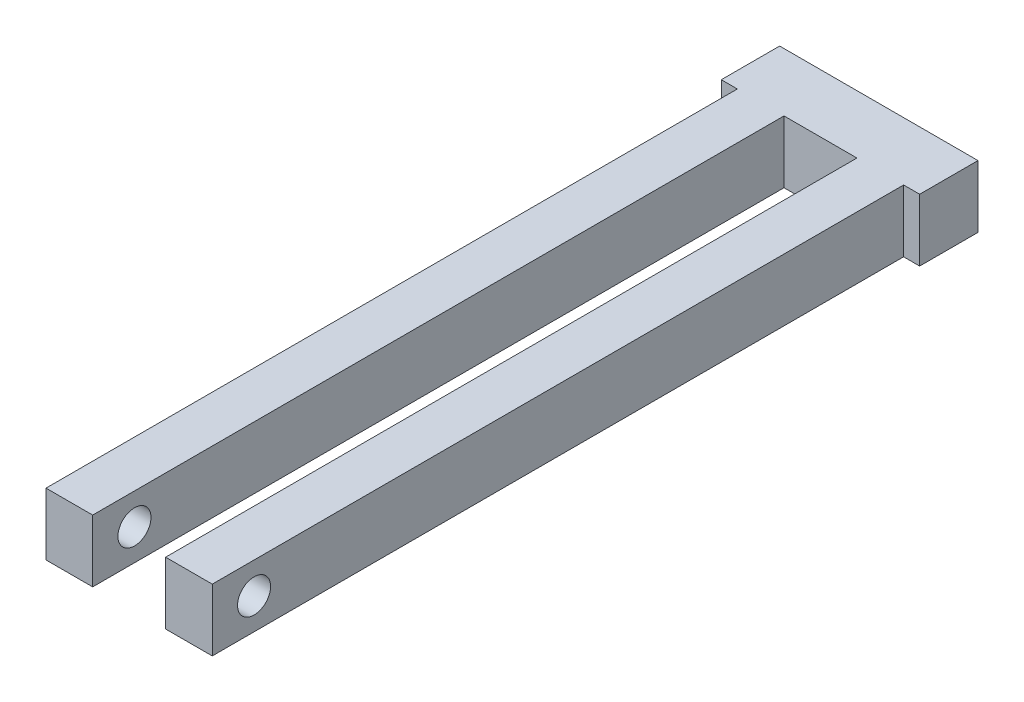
ISO-10303-21;
HEADER;
FILE_DESCRIPTION(('STEP AP214'),'2;1');
FILE_NAME('part.step','',(''),(''),'','','');
FILE_SCHEMA(('AUTOMOTIVE_DESIGN { 1 0 10303 214 1 1 1 1 }'));
ENDSEC;
DATA;
#1=APPLICATION_CONTEXT('core data for automotive mechanical design processes');
#2=APPLICATION_PROTOCOL_DEFINITION('international standard','automotive_design',2000,#1);
#3=PRODUCT_CONTEXT('',#1,'mechanical');
#4=PRODUCT('Part','Part','',(#3));
#5=PRODUCT_RELATED_PRODUCT_CATEGORY('part','',(#4));
#6=PRODUCT_DEFINITION_FORMATION('','',#4);
#7=PRODUCT_DEFINITION_CONTEXT('part definition',#1,'design');
#8=PRODUCT_DEFINITION('design','',#6,#7);
#9=PRODUCT_DEFINITION_SHAPE('','',#8);
#10=(LENGTH_UNIT() NAMED_UNIT(*) SI_UNIT(.MILLI.,.METRE.));
#11=(NAMED_UNIT(*) PLANE_ANGLE_UNIT() SI_UNIT($,.RADIAN.));
#12=(NAMED_UNIT(*) SI_UNIT($,.STERADIAN.) SOLID_ANGLE_UNIT());
#13=UNCERTAINTY_MEASURE_WITH_UNIT(LENGTH_MEASURE(1.E-05),#10,'distance_accuracy_value','');
#14=(GEOMETRIC_REPRESENTATION_CONTEXT(3) GLOBAL_UNCERTAINTY_ASSIGNED_CONTEXT((#13)) GLOBAL_UNIT_ASSIGNED_CONTEXT((#10,
#11,#12)) REPRESENTATION_CONTEXT('',''));
#15=CARTESIAN_POINT('',(0.,0.,0.));
#16=DIRECTION('',(0.,0.,1.));
#17=DIRECTION('',(1.,0.,0.));
#18=AXIS2_PLACEMENT_3D('',#15,#16,#17);
#19=CARTESIAN_POINT('',(0.,44.,-124.));
#20=DIRECTION('',(0.,0.,1.));
#21=DIRECTION('',(1.,0.,0.));
#22=AXIS2_PLACEMENT_3D('',#19,#20,#21);
#23=PLANE('',#22);
#24=DIRECTION('',(0.,-1.,0.));
#25=VECTOR('',#24,1.);
#26=CARTESIAN_POINT('',(3.75,44.,-124.));
#27=LINE('',#26,#25);
#28=CARTESIAN_POINT('',(3.75,47.2,-124.));
#29=VERTEX_POINT('',#28);
#30=CARTESIAN_POINT('',(3.75,40.8,-124.));
#31=VERTEX_POINT('',#30);
#32=EDGE_CURVE('E139',#29,#31,#27,.T.);
#33=ORIENTED_EDGE('',*,*,#32,.F.);
#34=DIRECTION('',(1.,0.,0.));
#35=VECTOR('',#34,1.);
#36=CARTESIAN_POINT('',(0.,47.2,-124.));
#37=LINE('',#36,#35);
#38=CARTESIAN_POINT('',(-3.75,47.2,-124.));
#39=VERTEX_POINT('',#38);
#40=EDGE_CURVE('E197',#39,#29,#37,.T.);
#41=ORIENTED_EDGE('',*,*,#40,.F.);
#42=DIRECTION('',(0.,1.,0.));
#43=VECTOR('',#42,1.);
#44=CARTESIAN_POINT('',(-3.75,44.,-124.));
#45=LINE('',#44,#43);
#46=CARTESIAN_POINT('',(-3.75,40.8,-124.));
#47=VERTEX_POINT('',#46);
#48=EDGE_CURVE('E159',#47,#39,#45,.T.);
#49=ORIENTED_EDGE('',*,*,#48,.F.);
#50=DIRECTION('',(-1.,0.,0.));
#51=VECTOR('',#50,1.);
#52=CARTESIAN_POINT('',(0.,40.8,-124.));
#53=LINE('',#52,#51);
#54=EDGE_CURVE('E25',#31,#47,#53,.T.);
#55=ORIENTED_EDGE('',*,*,#54,.F.);
#56=EDGE_LOOP('',(#33,#41,#49,#55));
#57=FACE_BOUND('',#56,.T.);
#58=ADVANCED_FACE('F16',(#57),#23,.T.);
#59=DIRECTION('',(0.,-1.,0.));
#60=VECTOR('',#59,1.);
#61=CARTESIAN_POINT('',(-8.55,44.,-124.));
#62=LINE('',#61,#60);
#63=CARTESIAN_POINT('',(-8.55,47.2,-124.));
#64=VERTEX_POINT('',#63);
#65=CARTESIAN_POINT('',(-8.55,40.8,-124.));
#66=VERTEX_POINT('',#65);
#67=EDGE_CURVE('E162',#64,#66,#62,.T.);
#68=ORIENTED_EDGE('',*,*,#67,.F.);
#69=CARTESIAN_POINT('',(-10.2,47.2,-124.));
#70=VERTEX_POINT('',#69);
#71=EDGE_CURVE('E194',#70,#64,#37,.T.);
#72=ORIENTED_EDGE('',*,*,#71,.F.);
#73=DIRECTION('',(0.,1.,0.));
#74=VECTOR('',#73,1.);
#75=CARTESIAN_POINT('',(-10.2,44.,-124.));
#76=LINE('',#75,#74);
#77=CARTESIAN_POINT('',(-10.2,40.8,-124.));
#78=VERTEX_POINT('',#77);
#79=EDGE_CURVE('E198',#78,#70,#76,.T.);
#80=ORIENTED_EDGE('',*,*,#79,.F.);
#81=EDGE_CURVE('E27',#66,#78,#53,.T.);
#82=ORIENTED_EDGE('',*,*,#81,.F.);
#83=EDGE_LOOP('',(#68,#72,#80,#82));
#84=FACE_BOUND('',#83,.T.);
#85=ADVANCED_FACE('F220',(#84),#23,.T.);
#86=DIRECTION('',(0.,1.,0.));
#87=VECTOR('',#86,1.);
#88=CARTESIAN_POINT('',(8.55,44.,-124.));
#89=LINE('',#88,#87);
#90=CARTESIAN_POINT('',(8.55,40.8,-124.));
#91=VERTEX_POINT('',#90);
#92=CARTESIAN_POINT('',(8.55,47.2,-124.));
#93=VERTEX_POINT('',#92);
#94=EDGE_CURVE('E37',#91,#93,#89,.T.);
#95=ORIENTED_EDGE('',*,*,#94,.F.);
#96=CARTESIAN_POINT('',(10.2,40.8,-124.));
#97=VERTEX_POINT('',#96);
#98=EDGE_CURVE('E10',#97,#91,#53,.T.);
#99=ORIENTED_EDGE('',*,*,#98,.F.);
#100=DIRECTION('',(0.,-1.,0.));
#101=VECTOR('',#100,1.);
#102=CARTESIAN_POINT('',(10.2,44.,-124.));
#103=LINE('',#102,#101);
#104=CARTESIAN_POINT('',(10.2,47.2,-124.));
#105=VERTEX_POINT('',#104);
#106=EDGE_CURVE('E188',#105,#97,#103,.T.);
#107=ORIENTED_EDGE('',*,*,#106,.F.);
#108=EDGE_CURVE('E195',#93,#105,#37,.T.);
#109=ORIENTED_EDGE('',*,*,#108,.F.);
#110=EDGE_LOOP('',(#95,#99,#107,#109));
#111=FACE_BOUND('',#110,.T.);
#112=ADVANCED_FACE('F18',(#111),#23,.T.);
#113=CARTESIAN_POINT('',(0.,40.8,-130.));
#114=DIRECTION('',(0.,-1.,0.));
#115=DIRECTION('',(0.,0.,-1.));
#116=AXIS2_PLACEMENT_3D('',#113,#114,#115);
#117=PLANE('',#116);
#118=ORIENTED_EDGE('',*,*,#98,.T.);
#119=DIRECTION('',(0.,0.,1.));
#120=VECTOR('',#119,1.);
#121=CARTESIAN_POINT('',(8.55,40.8,-124.35));
#122=LINE('',#121,#120);
#123=CARTESIAN_POINT('',(8.55,40.8,-52.9));
#124=VERTEX_POINT('',#123);
#125=EDGE_CURVE('E104',#91,#124,#122,.T.);
#126=ORIENTED_EDGE('',*,*,#125,.T.);
#127=DIRECTION('',(-1.,0.,0.));
#128=VECTOR('',#127,1.);
#129=CARTESIAN_POINT('',(6.15,40.8,-52.9));
#130=LINE('',#129,#128);
#131=CARTESIAN_POINT('',(3.75,40.8,-52.9));
#132=VERTEX_POINT('',#131);
#133=EDGE_CURVE('E108',#124,#132,#130,.T.);
#134=ORIENTED_EDGE('',*,*,#133,.T.);
#135=DIRECTION('',(0.,0.,1.));
#136=VECTOR('',#135,1.);
#137=CARTESIAN_POINT('',(3.75,40.8,-124.35));
#138=LINE('',#137,#136);
#139=EDGE_CURVE('E127',#31,#132,#138,.T.);
#140=ORIENTED_EDGE('',*,*,#139,.F.);
#141=ORIENTED_EDGE('',*,*,#54,.T.);
#142=DIRECTION('',(0.,0.,1.));
#143=VECTOR('',#142,1.);
#144=CARTESIAN_POINT('',(-3.75,40.8,-124.35));
#145=LINE('',#144,#143);
#146=CARTESIAN_POINT('',(-3.75,40.8,-52.9));
#147=VERTEX_POINT('',#146);
#148=EDGE_CURVE('E138',#47,#147,#145,.T.);
#149=ORIENTED_EDGE('',*,*,#148,.T.);
#150=DIRECTION('',(-1.,0.,0.));
#151=VECTOR('',#150,1.);
#152=CARTESIAN_POINT('',(-6.15,40.8,-52.9));
#153=LINE('',#152,#151);
#154=CARTESIAN_POINT('',(-8.55,40.8,-52.9));
#155=VERTEX_POINT('',#154);
#156=EDGE_CURVE('E160',#147,#155,#153,.T.);
#157=ORIENTED_EDGE('',*,*,#156,.T.);
#158=DIRECTION('',(0.,0.,1.));
#159=VECTOR('',#158,1.);
#160=CARTESIAN_POINT('',(-8.55,40.8,-124.35));
#161=LINE('',#160,#159);
#162=EDGE_CURVE('E148',#66,#155,#161,.T.);
#163=ORIENTED_EDGE('',*,*,#162,.F.);
#164=ORIENTED_EDGE('',*,*,#81,.T.);
#165=DIRECTION('',(0.,0.,1.));
#166=VECTOR('',#165,1.);
#167=CARTESIAN_POINT('',(-10.2,40.8,-130.));
#168=LINE('',#167,#166);
#169=CARTESIAN_POINT('',(-10.2,40.8,-130.));
#170=VERTEX_POINT('',#169);
#171=EDGE_CURVE('E186',#170,#78,#168,.T.);
#172=ORIENTED_EDGE('',*,*,#171,.F.);
#173=DIRECTION('',(1.,0.,0.));
#174=VECTOR('',#173,1.);
#175=CARTESIAN_POINT('',(0.,40.8,-130.));
#176=LINE('',#175,#174);
#177=CARTESIAN_POINT('',(10.2,40.8,-130.));
#178=VERTEX_POINT('',#177);
#179=EDGE_CURVE('E167',#170,#178,#176,.T.);
#180=ORIENTED_EDGE('',*,*,#179,.T.);
#181=DIRECTION('',(0.,0.,1.));
#182=VECTOR('',#181,1.);
#183=CARTESIAN_POINT('',(10.2,40.8,-130.));
#184=LINE('',#183,#182);
#185=EDGE_CURVE('E174',#178,#97,#184,.T.);
#186=ORIENTED_EDGE('',*,*,#185,.T.);
#187=EDGE_LOOP('',(#118,#126,#134,#140,#141,#149,#157,#163,#164,#172,#180,#186));
#188=FACE_BOUND('',#187,.T.);
#189=ADVANCED_FACE('F110',(#188),#117,.T.);
#190=CARTESIAN_POINT('',(-10.2,44.,-130.));
#191=DIRECTION('',(-1.,0.,0.));
#192=DIRECTION('',(0.,0.,1.));
#193=AXIS2_PLACEMENT_3D('',#190,#191,#192);
#194=PLANE('',#193);
#195=ORIENTED_EDGE('',*,*,#171,.T.);
#196=ORIENTED_EDGE('',*,*,#79,.T.);
#197=DIRECTION('',(0.,0.,1.));
#198=VECTOR('',#197,1.);
#199=CARTESIAN_POINT('',(-10.2,47.2,-130.));
#200=LINE('',#199,#198);
#201=CARTESIAN_POINT('',(-10.2,47.2,-130.));
#202=VERTEX_POINT('',#201);
#203=EDGE_CURVE('E183',#202,#70,#200,.T.);
#204=ORIENTED_EDGE('',*,*,#203,.F.);
#205=DIRECTION('',(0.,-1.,0.));
#206=VECTOR('',#205,1.);
#207=CARTESIAN_POINT('',(-10.2,44.,-130.));
#208=LINE('',#207,#206);
#209=EDGE_CURVE('E166',#202,#170,#208,.T.);
#210=ORIENTED_EDGE('',*,*,#209,.T.);
#211=EDGE_LOOP('',(#195,#196,#204,#210));
#212=FACE_BOUND('',#211,.T.);
#213=ADVANCED_FACE('F225',(#212),#194,.T.);
#214=CARTESIAN_POINT('',(0.,47.2,-130.));
#215=DIRECTION('',(0.,1.,0.));
#216=DIRECTION('',(0.,0.,1.));
#217=AXIS2_PLACEMENT_3D('',#214,#215,#216);
#218=PLANE('',#217);
#219=ORIENTED_EDGE('',*,*,#40,.T.);
#220=DIRECTION('',(0.,0.,1.));
#221=VECTOR('',#220,1.);
#222=CARTESIAN_POINT('',(3.75,47.2,-124.35));
#223=LINE('',#222,#221);
#224=CARTESIAN_POINT('',(3.75,47.2,-52.9));
#225=VERTEX_POINT('',#224);
#226=EDGE_CURVE('E135',#29,#225,#223,.T.);
#227=ORIENTED_EDGE('',*,*,#226,.T.);
#228=DIRECTION('',(1.,0.,0.));
#229=VECTOR('',#228,1.);
#230=CARTESIAN_POINT('',(6.15,47.2,-52.9));
#231=LINE('',#230,#229);
#232=CARTESIAN_POINT('',(8.55,47.2,-52.9));
#233=VERTEX_POINT('',#232);
#234=EDGE_CURVE('E128',#225,#233,#231,.T.);
#235=ORIENTED_EDGE('',*,*,#234,.T.);
#236=DIRECTION('',(0.,0.,1.));
#237=VECTOR('',#236,1.);
#238=CARTESIAN_POINT('',(8.55,47.2,-124.35));
#239=LINE('',#238,#237);
#240=EDGE_CURVE('E111',#93,#233,#239,.T.);
#241=ORIENTED_EDGE('',*,*,#240,.F.);
#242=ORIENTED_EDGE('',*,*,#108,.T.);
#243=DIRECTION('',(0.,0.,1.));
#244=VECTOR('',#243,1.);
#245=CARTESIAN_POINT('',(10.2,47.2,-130.));
#246=LINE('',#245,#244);
#247=CARTESIAN_POINT('',(10.2,47.2,-130.));
#248=VERTEX_POINT('',#247);
#249=EDGE_CURVE('E179',#248,#105,#246,.T.);
#250=ORIENTED_EDGE('',*,*,#249,.F.);
#251=DIRECTION('',(-1.,0.,0.));
#252=VECTOR('',#251,1.);
#253=CARTESIAN_POINT('',(0.,47.2,-130.));
#254=LINE('',#253,#252);
#255=EDGE_CURVE('E173',#248,#202,#254,.T.);
#256=ORIENTED_EDGE('',*,*,#255,.T.);
#257=ORIENTED_EDGE('',*,*,#203,.T.);
#258=ORIENTED_EDGE('',*,*,#71,.T.);
#259=DIRECTION('',(0.,0.,1.));
#260=VECTOR('',#259,1.);
#261=CARTESIAN_POINT('',(-8.55,47.2,-124.35));
#262=LINE('',#261,#260);
#263=CARTESIAN_POINT('',(-8.55,47.2,-52.9));
#264=VERTEX_POINT('',#263);
#265=EDGE_CURVE('E145',#64,#264,#262,.T.);
#266=ORIENTED_EDGE('',*,*,#265,.T.);
#267=DIRECTION('',(1.,0.,0.));
#268=VECTOR('',#267,1.);
#269=CARTESIAN_POINT('',(-6.15,47.2,-52.9));
#270=LINE('',#269,#268);
#271=CARTESIAN_POINT('',(-3.75,47.2,-52.9));
#272=VERTEX_POINT('',#271);
#273=EDGE_CURVE('E151',#264,#272,#270,.T.);
#274=ORIENTED_EDGE('',*,*,#273,.T.);
#275=DIRECTION('',(0.,0.,1.));
#276=VECTOR('',#275,1.);
#277=CARTESIAN_POINT('',(-3.75,47.2,-124.35));
#278=LINE('',#277,#276);
#279=EDGE_CURVE('E142',#39,#272,#278,.T.);
#280=ORIENTED_EDGE('',*,*,#279,.F.);
#281=EDGE_LOOP('',(#219,#227,#235,#241,#242,#250,#256,#257,#258,#266,#274,#280));
#282=FACE_BOUND('',#281,.T.);
#283=ADVANCED_FACE('F218',(#282),#218,.T.);
#284=CARTESIAN_POINT('',(0.,44.,-130.));
#285=DIRECTION('',(0.,0.,-1.));
#286=DIRECTION('',(-1.,0.,0.));
#287=AXIS2_PLACEMENT_3D('',#284,#285,#286);
#288=PLANE('',#287);
#289=DIRECTION('',(0.,1.,0.));
#290=VECTOR('',#289,1.);
#291=CARTESIAN_POINT('',(10.2,44.,-130.));
#292=LINE('',#291,#290);
#293=EDGE_CURVE('E168',#178,#248,#292,.T.);
#294=ORIENTED_EDGE('',*,*,#293,.F.);
#295=ORIENTED_EDGE('',*,*,#179,.F.);
#296=ORIENTED_EDGE('',*,*,#209,.F.);
#297=ORIENTED_EDGE('',*,*,#255,.F.);
#298=EDGE_LOOP('',(#294,#295,#296,#297));
#299=FACE_BOUND('',#298,.T.);
#300=ADVANCED_FACE('F226',(#299),#288,.T.);
#301=CARTESIAN_POINT('',(10.2,44.,-130.));
#302=DIRECTION('',(1.,0.,0.));
#303=DIRECTION('',(0.,0.,-1.));
#304=AXIS2_PLACEMENT_3D('',#301,#302,#303);
#305=PLANE('',#304);
#306=ORIENTED_EDGE('',*,*,#293,.T.);
#307=ORIENTED_EDGE('',*,*,#249,.T.);
#308=ORIENTED_EDGE('',*,*,#106,.T.);
#309=ORIENTED_EDGE('',*,*,#185,.F.);
#310=EDGE_LOOP('',(#306,#307,#308,#309));
#311=FACE_BOUND('',#310,.T.);
#312=ADVANCED_FACE('F229',(#311),#305,.T.);
#313=CARTESIAN_POINT('',(-6.15,44.,-52.9));
#314=DIRECTION('',(0.,0.,1.));
#315=DIRECTION('',(1.,0.,0.));
#316=AXIS2_PLACEMENT_3D('',#313,#314,#315);
#317=PLANE('',#316);
#318=ORIENTED_EDGE('',*,*,#156,.F.);
#319=DIRECTION('',(0.,-1.,0.));
#320=VECTOR('',#319,1.);
#321=CARTESIAN_POINT('',(-3.75,44.,-52.9));
#322=LINE('',#321,#320);
#323=EDGE_CURVE('E146',#272,#147,#322,.T.);
#324=ORIENTED_EDGE('',*,*,#323,.F.);
#325=ORIENTED_EDGE('',*,*,#273,.F.);
#326=DIRECTION('',(0.,1.,0.));
#327=VECTOR('',#326,1.);
#328=CARTESIAN_POINT('',(-8.55,44.,-52.9));
#329=LINE('',#328,#327);
#330=EDGE_CURVE('E152',#155,#264,#329,.T.);
#331=ORIENTED_EDGE('',*,*,#330,.F.);
#332=EDGE_LOOP('',(#318,#324,#325,#331));
#333=FACE_BOUND('',#332,.T.);
#334=ADVANCED_FACE('F211',(#333),#317,.T.);
#335=CARTESIAN_POINT('',(-8.55,44.,-124.35));
#336=DIRECTION('',(-1.,0.,0.));
#337=DIRECTION('',(0.,0.,1.));
#338=AXIS2_PLACEMENT_3D('',#335,#336,#337);
#339=PLANE('',#338);
#340=CARTESIAN_POINT('',(-8.55,44.,-57.2));
#341=DIRECTION('',(-1.,0.,0.));
#342=DIRECTION('',(0.,0.,1.));
#343=AXIS2_PLACEMENT_3D('',#340,#341,#342);
#344=CIRCLE('',#343,1.7);
#345=CARTESIAN_POINT('',(-8.55,44.,-55.5));
#346=VERTEX_POINT('',#345);
#347=EDGE_CURVE('E113',#346,#346,#344,.T.);
#348=ORIENTED_EDGE('',*,*,#347,.F.);
#349=EDGE_LOOP('',(#348));
#350=FACE_BOUND('',#349,.T.);
#351=ORIENTED_EDGE('',*,*,#265,.F.);
#352=ORIENTED_EDGE('',*,*,#67,.T.);
#353=ORIENTED_EDGE('',*,*,#162,.T.);
#354=ORIENTED_EDGE('',*,*,#330,.T.);
#355=EDGE_LOOP('',(#351,#352,#353,#354));
#356=FACE_BOUND('',#355,.T.);
#357=ADVANCED_FACE('F214',(#350,#356),#339,.T.);
#358=CARTESIAN_POINT('',(-3.75,44.,-124.35));
#359=DIRECTION('',(1.,0.,0.));
#360=DIRECTION('',(0.,0.,-1.));
#361=AXIS2_PLACEMENT_3D('',#358,#359,#360);
#362=PLANE('',#361);
#363=CARTESIAN_POINT('',(-3.75,44.,-57.2));
#364=DIRECTION('',(1.,0.,0.));
#365=DIRECTION('',(0.,0.,-1.));
#366=AXIS2_PLACEMENT_3D('',#363,#364,#365);
#367=CIRCLE('',#366,1.7);
#368=CARTESIAN_POINT('',(-3.75,44.,-58.9));
#369=VERTEX_POINT('',#368);
#370=EDGE_CURVE('E232',#369,#369,#367,.T.);
#371=ORIENTED_EDGE('',*,*,#370,.F.);
#372=EDGE_LOOP('',(#371));
#373=FACE_BOUND('',#372,.T.);
#374=ORIENTED_EDGE('',*,*,#148,.F.);
#375=ORIENTED_EDGE('',*,*,#48,.T.);
#376=ORIENTED_EDGE('',*,*,#279,.T.);
#377=ORIENTED_EDGE('',*,*,#323,.T.);
#378=EDGE_LOOP('',(#374,#375,#376,#377));
#379=FACE_BOUND('',#378,.T.);
#380=ADVANCED_FACE('F210',(#373,#379),#362,.T.);
#381=CARTESIAN_POINT('',(6.15,44.,-52.9));
#382=DIRECTION('',(0.,0.,1.));
#383=DIRECTION('',(1.,0.,0.));
#384=AXIS2_PLACEMENT_3D('',#381,#382,#383);
#385=PLANE('',#384);
#386=ORIENTED_EDGE('',*,*,#133,.F.);
#387=DIRECTION('',(0.,-1.,0.));
#388=VECTOR('',#387,1.);
#389=CARTESIAN_POINT('',(8.55,44.,-52.9));
#390=LINE('',#389,#388);
#391=EDGE_CURVE('E121',#233,#124,#390,.T.);
#392=ORIENTED_EDGE('',*,*,#391,.F.);
#393=ORIENTED_EDGE('',*,*,#234,.F.);
#394=DIRECTION('',(0.,1.,0.));
#395=VECTOR('',#394,1.);
#396=CARTESIAN_POINT('',(3.75,44.,-52.9));
#397=LINE('',#396,#395);
#398=EDGE_CURVE('E123',#132,#225,#397,.T.);
#399=ORIENTED_EDGE('',*,*,#398,.F.);
#400=EDGE_LOOP('',(#386,#392,#393,#399));
#401=FACE_BOUND('',#400,.T.);
#402=ADVANCED_FACE('F118',(#401),#385,.T.);
#403=CARTESIAN_POINT('',(3.75,44.,-124.35));
#404=DIRECTION('',(-1.,0.,0.));
#405=DIRECTION('',(0.,0.,1.));
#406=AXIS2_PLACEMENT_3D('',#403,#404,#405);
#407=PLANE('',#406);
#408=CARTESIAN_POINT('',(3.75,44.,-57.2));
#409=DIRECTION('',(-1.,0.,0.));
#410=DIRECTION('',(0.,0.,1.));
#411=AXIS2_PLACEMENT_3D('',#408,#409,#410);
#412=CIRCLE('',#411,1.7);
#413=CARTESIAN_POINT('',(3.75,44.,-55.5));
#414=VERTEX_POINT('',#413);
#415=EDGE_CURVE('E236',#414,#414,#412,.T.);
#416=ORIENTED_EDGE('',*,*,#415,.F.);
#417=EDGE_LOOP('',(#416));
#418=FACE_BOUND('',#417,.T.);
#419=ORIENTED_EDGE('',*,*,#226,.F.);
#420=ORIENTED_EDGE('',*,*,#32,.T.);
#421=ORIENTED_EDGE('',*,*,#139,.T.);
#422=ORIENTED_EDGE('',*,*,#398,.T.);
#423=EDGE_LOOP('',(#419,#420,#421,#422));
#424=FACE_BOUND('',#423,.T.);
#425=ADVANCED_FACE('F250',(#418,#424),#407,.T.);
#426=CARTESIAN_POINT('',(8.55,44.,-124.35));
#427=DIRECTION('',(1.,0.,0.));
#428=DIRECTION('',(0.,0.,-1.));
#429=AXIS2_PLACEMENT_3D('',#426,#427,#428);
#430=PLANE('',#429);
#431=CARTESIAN_POINT('',(8.55,44.,-57.2));
#432=DIRECTION('',(1.,0.,0.));
#433=DIRECTION('',(0.,0.,-1.));
#434=AXIS2_PLACEMENT_3D('',#431,#432,#433);
#435=CIRCLE('',#434,1.7);
#436=CARTESIAN_POINT('',(8.55,44.,-58.9));
#437=VERTEX_POINT('',#436);
#438=EDGE_CURVE('E20',#437,#437,#435,.T.);
#439=ORIENTED_EDGE('',*,*,#438,.F.);
#440=EDGE_LOOP('',(#439));
#441=FACE_BOUND('',#440,.T.);
#442=ORIENTED_EDGE('',*,*,#125,.F.);
#443=ORIENTED_EDGE('',*,*,#94,.T.);
#444=ORIENTED_EDGE('',*,*,#240,.T.);
#445=ORIENTED_EDGE('',*,*,#391,.T.);
#446=EDGE_LOOP('',(#442,#443,#444,#445));
#447=FACE_BOUND('',#446,.T.);
#448=ADVANCED_FACE('F124',(#441,#447),#430,.T.);
#449=CARTESIAN_POINT('',(-9.,44.,-57.2));
#450=DIRECTION('',(1.,0.,0.));
#451=DIRECTION('',(0.,0.,-1.));
#452=AXIS2_PLACEMENT_3D('',#449,#450,#451);
#453=CYLINDRICAL_SURFACE('',#452,1.7);
#454=ORIENTED_EDGE('',*,*,#415,.T.);
#455=EDGE_LOOP('',(#454));
#456=FACE_BOUND('',#455,.T.);
#457=ORIENTED_EDGE('',*,*,#438,.T.);
#458=EDGE_LOOP('',(#457));
#459=FACE_BOUND('',#458,.T.);
#460=ADVANCED_FACE('F243',(#456,#459),#453,.F.);
#461=ORIENTED_EDGE('',*,*,#347,.T.);
#462=EDGE_LOOP('',(#461));
#463=FACE_BOUND('',#462,.T.);
#464=ORIENTED_EDGE('',*,*,#370,.T.);
#465=EDGE_LOOP('',(#464));
#466=FACE_BOUND('',#465,.T.);
#467=ADVANCED_FACE('F255',(#463,#466),#453,.F.);
#468=CLOSED_SHELL('',(#58,#85,#112,#189,#213,#283,#300,#312,#334,#357,#380,#402,#425,#448,#460,#467));
#469=MANIFOLD_SOLID_BREP('B1',#468);
#470=ADVANCED_BREP_SHAPE_REPRESENTATION('',(#18,#469),#14);
#471=SHAPE_DEFINITION_REPRESENTATION(#9,#470);
ENDSEC;
END-ISO-10303-21;
